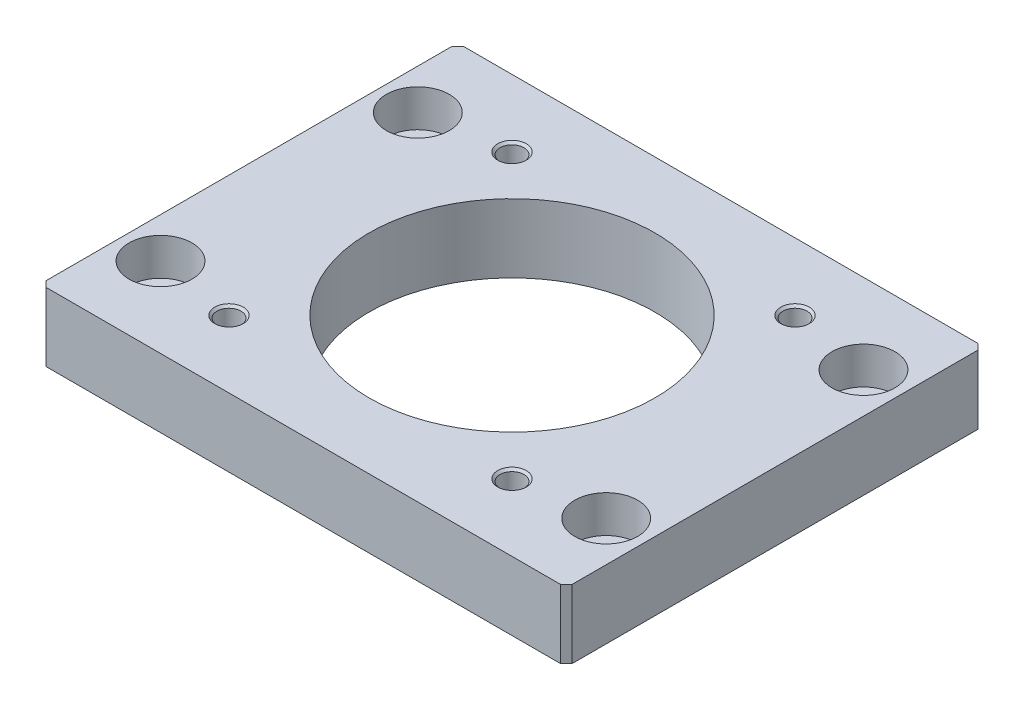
ISO-10303-21;
HEADER;
FILE_DESCRIPTION(('STEP AP214'),'2;1');
FILE_NAME('part.step','',(''),(''),'','','');
FILE_SCHEMA(('AUTOMOTIVE_DESIGN { 1 0 10303 214 1 1 1 1 }'));
ENDSEC;
DATA;
#1=APPLICATION_CONTEXT('core data for automotive mechanical design processes');
#2=APPLICATION_PROTOCOL_DEFINITION('international standard','automotive_design',2000,#1);
#3=PRODUCT_CONTEXT('',#1,'mechanical');
#4=PRODUCT('Part','Part','',(#3));
#5=PRODUCT_RELATED_PRODUCT_CATEGORY('part','',(#4));
#6=PRODUCT_DEFINITION_FORMATION('','',#4);
#7=PRODUCT_DEFINITION_CONTEXT('part definition',#1,'design');
#8=PRODUCT_DEFINITION('design','',#6,#7);
#9=PRODUCT_DEFINITION_SHAPE('','',#8);
#10=(LENGTH_UNIT() NAMED_UNIT(*) SI_UNIT(.MILLI.,.METRE.));
#11=(NAMED_UNIT(*) PLANE_ANGLE_UNIT() SI_UNIT($,.RADIAN.));
#12=(NAMED_UNIT(*) SI_UNIT($,.STERADIAN.) SOLID_ANGLE_UNIT());
#13=UNCERTAINTY_MEASURE_WITH_UNIT(LENGTH_MEASURE(1.E-05),#10,'distance_accuracy_value','');
#14=(GEOMETRIC_REPRESENTATION_CONTEXT(3) GLOBAL_UNCERTAINTY_ASSIGNED_CONTEXT((#13)) GLOBAL_UNIT_ASSIGNED_CONTEXT((#10,
#11,#12)) REPRESENTATION_CONTEXT('',''));
#15=CARTESIAN_POINT('',(0.,0.,0.));
#16=DIRECTION('',(0.,0.,1.));
#17=DIRECTION('',(1.,0.,0.));
#18=AXIS2_PLACEMENT_3D('',#15,#16,#17);
#19=CARTESIAN_POINT('',(-24.74873734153,11.6000000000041,-24.74873734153));
#20=DIRECTION('',(0.,1.,0.));
#21=DIRECTION('',(-1.,0.,0.));
#22=AXIS2_PLACEMENT_3D('',#19,#20,#21);
#23=CONICAL_SURFACE('',#22,2.09999999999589,0.785398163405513);
#24=CARTESIAN_POINT('',(-24.74873734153,11.6,-24.74873734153));
#25=DIRECTION('',(0.,1.,0.));
#26=DIRECTION('',(1.,0.,0.));
#27=AXIS2_PLACEMENT_3D('',#24,#25,#26);
#28=CIRCLE('',#27,2.1);
#29=CARTESIAN_POINT('',(-22.64873734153,11.6,-24.74873734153));
#30=VERTEX_POINT('',#29);
#31=EDGE_CURVE('E191',#30,#30,#28,.F.);
#32=ORIENTED_EDGE('',*,*,#31,.T.);
#33=EDGE_LOOP('',(#32));
#34=FACE_BOUND('',#33,.T.);
#35=CARTESIAN_POINT('',(-24.74873734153,12.0000000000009,-24.74873734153));
#36=DIRECTION('',(0.,1.,0.));
#37=DIRECTION('',(-1.,0.,0.));
#38=AXIS2_PLACEMENT_3D('',#35,#36,#37);
#39=CIRCLE('',#38,2.49999999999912);
#40=CARTESIAN_POINT('',(-27.2487373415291,12.0000000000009,-24.74873734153));
#41=VERTEX_POINT('',#40);
#42=EDGE_CURVE('E174',#41,#41,#39,.T.);
#43=ORIENTED_EDGE('',*,*,#42,.T.);
#44=EDGE_LOOP('',(#43));
#45=FACE_BOUND('',#44,.T.);
#46=ADVANCED_FACE('F16',(#34,#45),#23,.F.);
#47=CARTESIAN_POINT('',(24.74873734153,11.6000000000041,-24.74873734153));
#48=DIRECTION('',(0.,1.,0.));
#49=DIRECTION('',(-1.,0.,0.));
#50=AXIS2_PLACEMENT_3D('',#47,#48,#49);
#51=CONICAL_SURFACE('',#50,2.09999999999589,0.785398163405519);
#52=CARTESIAN_POINT('',(24.74873734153,11.6,-24.74873734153));
#53=DIRECTION('',(0.,1.,0.));
#54=DIRECTION('',(1.,0.,0.));
#55=AXIS2_PLACEMENT_3D('',#52,#53,#54);
#56=CIRCLE('',#55,2.1);
#57=CARTESIAN_POINT('',(26.84873734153,11.6,-24.74873734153));
#58=VERTEX_POINT('',#57);
#59=EDGE_CURVE('E195',#58,#58,#56,.F.);
#60=ORIENTED_EDGE('',*,*,#59,.T.);
#61=EDGE_LOOP('',(#60));
#62=FACE_BOUND('',#61,.T.);
#63=CARTESIAN_POINT('',(24.74873734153,12.0000000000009,-24.74873734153));
#64=DIRECTION('',(0.,1.,0.));
#65=DIRECTION('',(-1.,0.,0.));
#66=AXIS2_PLACEMENT_3D('',#63,#64,#65);
#67=CIRCLE('',#66,2.49999999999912);
#68=CARTESIAN_POINT('',(22.2487373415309,12.0000000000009,-24.74873734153));
#69=VERTEX_POINT('',#68);
#70=EDGE_CURVE('E171',#69,#69,#67,.T.);
#71=ORIENTED_EDGE('',*,*,#70,.T.);
#72=EDGE_LOOP('',(#71));
#73=FACE_BOUND('',#72,.T.);
#74=ADVANCED_FACE('F359',(#62,#73),#51,.F.);
#75=CARTESIAN_POINT('',(-24.74873734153,11.6,24.74873734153));
#76=DIRECTION('',(0.,1.,0.));
#77=DIRECTION('',(0.,0.,1.));
#78=AXIS2_PLACEMENT_3D('',#75,#76,#77);
#79=CONICAL_SURFACE('',#78,2.1,0.785398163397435);
#80=CARTESIAN_POINT('',(-24.74873734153,11.6,24.74873734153));
#81=DIRECTION('',(0.,1.,0.));
#82=DIRECTION('',(1.,0.,0.));
#83=AXIS2_PLACEMENT_3D('',#80,#81,#82);
#84=CIRCLE('',#83,2.1);
#85=CARTESIAN_POINT('',(-22.64873734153,11.6,24.74873734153));
#86=VERTEX_POINT('',#85);
#87=EDGE_CURVE('E208',#86,#86,#84,.F.);
#88=ORIENTED_EDGE('',*,*,#87,.T.);
#89=EDGE_LOOP('',(#88));
#90=FACE_BOUND('',#89,.T.);
#91=CARTESIAN_POINT('',(-24.74873734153,12.,24.74873734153));
#92=DIRECTION('',(0.,1.,0.));
#93=DIRECTION('',(0.,0.,1.));
#94=AXIS2_PLACEMENT_3D('',#91,#92,#93);
#95=CIRCLE('',#94,2.49999999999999);
#96=CARTESIAN_POINT('',(-24.74873734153,12.,27.24873734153));
#97=VERTEX_POINT('',#96);
#98=EDGE_CURVE('E168',#97,#97,#95,.T.);
#99=ORIENTED_EDGE('',*,*,#98,.T.);
#100=EDGE_LOOP('',(#99));
#101=FACE_BOUND('',#100,.T.);
#102=ADVANCED_FACE('F355',(#90,#101),#79,.F.);
#103=CARTESIAN_POINT('',(24.74873734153,11.6,24.74873734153));
#104=DIRECTION('',(0.,1.,0.));
#105=DIRECTION('',(0.,0.,1.));
#106=AXIS2_PLACEMENT_3D('',#103,#104,#105);
#107=CONICAL_SURFACE('',#106,2.1,0.785398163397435);
#108=CARTESIAN_POINT('',(24.74873734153,11.6,24.74873734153));
#109=DIRECTION('',(0.,1.,0.));
#110=DIRECTION('',(1.,0.,0.));
#111=AXIS2_PLACEMENT_3D('',#108,#109,#110);
#112=CIRCLE('',#111,2.1);
#113=CARTESIAN_POINT('',(26.84873734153,11.6,24.74873734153));
#114=VERTEX_POINT('',#113);
#115=EDGE_CURVE('E200',#114,#114,#112,.F.);
#116=ORIENTED_EDGE('',*,*,#115,.T.);
#117=EDGE_LOOP('',(#116));
#118=FACE_BOUND('',#117,.T.);
#119=CARTESIAN_POINT('',(24.74873734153,12.,24.74873734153));
#120=DIRECTION('',(0.,1.,0.));
#121=DIRECTION('',(0.,0.,1.));
#122=AXIS2_PLACEMENT_3D('',#119,#120,#121);
#123=CIRCLE('',#122,2.49999999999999);
#124=CARTESIAN_POINT('',(24.74873734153,12.,27.24873734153));
#125=VERTEX_POINT('',#124);
#126=EDGE_CURVE('E165',#125,#125,#123,.T.);
#127=ORIENTED_EDGE('',*,*,#126,.T.);
#128=EDGE_LOOP('',(#127));
#129=FACE_BOUND('',#128,.T.);
#130=ADVANCED_FACE('F352',(#118,#129),#107,.F.);
#131=CARTESIAN_POINT('',(38.9711431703,5.5,-22.5));
#132=DIRECTION('',(0.,1.,0.));
#133=DIRECTION('',(0.,0.,1.));
#134=AXIS2_PLACEMENT_3D('',#131,#132,#133);
#135=CYLINDRICAL_SURFACE('',#134,5.49999999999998);
#136=CARTESIAN_POINT('',(38.9711431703,5.5,-22.5));
#137=DIRECTION('',(0.,1.,0.));
#138=DIRECTION('',(0.,0.,1.));
#139=AXIS2_PLACEMENT_3D('',#136,#137,#138);
#140=CIRCLE('',#139,5.49999999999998);
#141=CARTESIAN_POINT('',(38.9711431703,5.5,-17.));
#142=VERTEX_POINT('',#141);
#143=EDGE_CURVE('E20',#142,#142,#140,.F.);
#144=ORIENTED_EDGE('',*,*,#143,.T.);
#145=EDGE_LOOP('',(#144));
#146=FACE_BOUND('',#145,.T.);
#147=CARTESIAN_POINT('',(38.9711431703,12.,-22.5));
#148=DIRECTION('',(0.,1.,0.));
#149=DIRECTION('',(0.,0.,1.));
#150=AXIS2_PLACEMENT_3D('',#147,#148,#149);
#151=CIRCLE('',#150,5.49999999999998);
#152=CARTESIAN_POINT('',(38.9711431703,12.,-17.));
#153=VERTEX_POINT('',#152);
#154=EDGE_CURVE('E162',#153,#153,#151,.T.);
#155=ORIENTED_EDGE('',*,*,#154,.T.);
#156=EDGE_LOOP('',(#155));
#157=FACE_BOUND('',#156,.T.);
#158=ADVANCED_FACE('F348',(#146,#157),#135,.F.);
#159=CARTESIAN_POINT('',(-38.9711431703,5.5,-22.5));
#160=DIRECTION('',(0.,1.,0.));
#161=DIRECTION('',(0.,0.,1.));
#162=AXIS2_PLACEMENT_3D('',#159,#160,#161);
#163=CYLINDRICAL_SURFACE('',#162,5.5);
#164=CARTESIAN_POINT('',(-38.9711431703,5.5,-22.5));
#165=DIRECTION('',(0.,1.,0.));
#166=DIRECTION('',(0.,0.,1.));
#167=AXIS2_PLACEMENT_3D('',#164,#165,#166);
#168=CIRCLE('',#167,5.5);
#169=CARTESIAN_POINT('',(-38.9711431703,5.5,-17.));
#170=VERTEX_POINT('',#169);
#171=EDGE_CURVE('E184',#170,#170,#168,.F.);
#172=ORIENTED_EDGE('',*,*,#171,.T.);
#173=EDGE_LOOP('',(#172));
#174=FACE_BOUND('',#173,.T.);
#175=CARTESIAN_POINT('',(-38.9711431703,12.,-22.5));
#176=DIRECTION('',(0.,1.,0.));
#177=DIRECTION('',(0.,0.,1.));
#178=AXIS2_PLACEMENT_3D('',#175,#176,#177);
#179=CIRCLE('',#178,5.5);
#180=CARTESIAN_POINT('',(-38.9711431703,12.,-17.));
#181=VERTEX_POINT('',#180);
#182=EDGE_CURVE('E159',#181,#181,#179,.T.);
#183=ORIENTED_EDGE('',*,*,#182,.T.);
#184=EDGE_LOOP('',(#183));
#185=FACE_BOUND('',#184,.T.);
#186=ADVANCED_FACE('F344',(#174,#185),#163,.F.);
#187=CARTESIAN_POINT('',(-38.9711431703,5.5,22.5));
#188=DIRECTION('',(0.,1.,0.));
#189=DIRECTION('',(0.,0.,1.));
#190=AXIS2_PLACEMENT_3D('',#187,#188,#189);
#191=CYLINDRICAL_SURFACE('',#190,5.5);
#192=CARTESIAN_POINT('',(-38.9711431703,5.5,22.5));
#193=DIRECTION('',(0.,1.,0.));
#194=DIRECTION('',(0.,0.,1.));
#195=AXIS2_PLACEMENT_3D('',#192,#193,#194);
#196=CIRCLE('',#195,5.5);
#197=CARTESIAN_POINT('',(-38.9711431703,5.5,28.));
#198=VERTEX_POINT('',#197);
#199=EDGE_CURVE('E90',#198,#198,#196,.F.);
#200=ORIENTED_EDGE('',*,*,#199,.T.);
#201=EDGE_LOOP('',(#200));
#202=FACE_BOUND('',#201,.T.);
#203=CARTESIAN_POINT('',(-38.9711431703,12.,22.5));
#204=DIRECTION('',(0.,1.,0.));
#205=DIRECTION('',(0.,0.,1.));
#206=AXIS2_PLACEMENT_3D('',#203,#204,#205);
#207=CIRCLE('',#206,5.5);
#208=CARTESIAN_POINT('',(-38.9711431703,12.,28.));
#209=VERTEX_POINT('',#208);
#210=EDGE_CURVE('E107',#209,#209,#207,.T.);
#211=ORIENTED_EDGE('',*,*,#210,.T.);
#212=EDGE_LOOP('',(#211));
#213=FACE_BOUND('',#212,.T.);
#214=ADVANCED_FACE('F341',(#202,#213),#191,.F.);
#215=CARTESIAN_POINT('',(38.9711431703,5.5,22.5));
#216=DIRECTION('',(0.,1.,0.));
#217=DIRECTION('',(0.,0.,1.));
#218=AXIS2_PLACEMENT_3D('',#215,#216,#217);
#219=CYLINDRICAL_SURFACE('',#218,5.49999999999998);
#220=CARTESIAN_POINT('',(38.9711431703,5.5,22.5));
#221=DIRECTION('',(0.,1.,0.));
#222=DIRECTION('',(0.,0.,1.));
#223=AXIS2_PLACEMENT_3D('',#220,#221,#222);
#224=CIRCLE('',#223,5.49999999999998);
#225=CARTESIAN_POINT('',(38.9711431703,5.5,28.));
#226=VERTEX_POINT('',#225);
#227=EDGE_CURVE('E186',#226,#226,#224,.F.);
#228=ORIENTED_EDGE('',*,*,#227,.T.);
#229=EDGE_LOOP('',(#228));
#230=FACE_BOUND('',#229,.T.);
#231=CARTESIAN_POINT('',(38.9711431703,12.,22.5));
#232=DIRECTION('',(0.,1.,0.));
#233=DIRECTION('',(0.,0.,1.));
#234=AXIS2_PLACEMENT_3D('',#231,#232,#233);
#235=CIRCLE('',#234,5.49999999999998);
#236=CARTESIAN_POINT('',(38.9711431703,12.,28.));
#237=VERTEX_POINT('',#236);
#238=EDGE_CURVE('E104',#237,#237,#235,.T.);
#239=ORIENTED_EDGE('',*,*,#238,.T.);
#240=EDGE_LOOP('',(#239));
#241=FACE_BOUND('',#240,.T.);
#242=ADVANCED_FACE('F338',(#230,#241),#219,.F.);
#243=CARTESIAN_POINT('',(-46.10961962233,12.24,-35.39038037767));
#244=DIRECTION('',(-0.707106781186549,0.,-0.707106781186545));
#245=DIRECTION('',(0.707106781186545,0.,-0.707106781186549));
#246=AXIS2_PLACEMENT_3D('',#243,#244,#245);
#247=PLANE('',#246);
#248=DIRECTION('',(0.707106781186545,0.,-0.707106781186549));
#249=VECTOR('',#248,1.);
#250=CARTESIAN_POINT('',(-46.10961962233,12.,-35.39038037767));
#251=LINE('',#250,#249);
#252=CARTESIAN_POINT('',(-46.,12.,-35.5));
#253=VERTEX_POINT('',#252);
#254=CARTESIAN_POINT('',(-45.,12.,-36.5));
#255=VERTEX_POINT('',#254);
#256=EDGE_CURVE('E177',#253,#255,#251,.T.);
#257=ORIENTED_EDGE('',*,*,#256,.T.);
#258=DIRECTION('',(0.,1.,0.));
#259=VECTOR('',#258,1.);
#260=CARTESIAN_POINT('',(-45.,6.,-36.5));
#261=LINE('',#260,#259);
#262=CARTESIAN_POINT('',(-45.,0.,-36.5));
#263=VERTEX_POINT('',#262);
#264=EDGE_CURVE('E100',#255,#263,#261,.F.);
#265=ORIENTED_EDGE('',*,*,#264,.T.);
#266=DIRECTION('',(-0.707106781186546,0.,0.70710678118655));
#267=VECTOR('',#266,1.);
#268=CARTESIAN_POINT('',(-45.5,0.,-36.));
#269=LINE('',#268,#267);
#270=CARTESIAN_POINT('',(-46.,0.,-35.5));
#271=VERTEX_POINT('',#270);
#272=EDGE_CURVE('E203',#271,#263,#269,.F.);
#273=ORIENTED_EDGE('',*,*,#272,.F.);
#274=DIRECTION('',(0.,-1.,0.));
#275=VECTOR('',#274,1.);
#276=CARTESIAN_POINT('',(-46.,6.,-35.5));
#277=LINE('',#276,#275);
#278=EDGE_CURVE('E215',#271,#253,#277,.F.);
#279=ORIENTED_EDGE('',*,*,#278,.T.);
#280=EDGE_LOOP('',(#257,#265,#273,#279));
#281=FACE_BOUND('',#280,.T.);
#282=ADVANCED_FACE('F261',(#281),#247,.T.);
#283=CARTESIAN_POINT('',(-44.89038037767,12.24,36.60961962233));
#284=DIRECTION('',(-0.707106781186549,0.,0.707106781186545));
#285=DIRECTION('',(-0.707106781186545,0.,-0.707106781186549));
#286=AXIS2_PLACEMENT_3D('',#283,#284,#285);
#287=PLANE('',#286);
#288=DIRECTION('',(-0.707106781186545,0.,-0.707106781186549));
#289=VECTOR('',#288,1.);
#290=CARTESIAN_POINT('',(-44.89038037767,12.,36.60961962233));
#291=LINE('',#290,#289);
#292=CARTESIAN_POINT('',(-45.,12.,36.5));
#293=VERTEX_POINT('',#292);
#294=CARTESIAN_POINT('',(-46.,12.,35.5));
#295=VERTEX_POINT('',#294);
#296=EDGE_CURVE('E179',#293,#295,#291,.T.);
#297=ORIENTED_EDGE('',*,*,#296,.T.);
#298=DIRECTION('',(0.,1.,0.));
#299=VECTOR('',#298,1.);
#300=CARTESIAN_POINT('',(-46.,6.,35.5));
#301=LINE('',#300,#299);
#302=CARTESIAN_POINT('',(-46.,0.,35.5));
#303=VERTEX_POINT('',#302);
#304=EDGE_CURVE('E214',#295,#303,#301,.F.);
#305=ORIENTED_EDGE('',*,*,#304,.T.);
#306=DIRECTION('',(0.707106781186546,0.,0.70710678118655));
#307=VECTOR('',#306,1.);
#308=CARTESIAN_POINT('',(-45.5,0.,36.));
#309=LINE('',#308,#307);
#310=CARTESIAN_POINT('',(-45.,0.,36.5));
#311=VERTEX_POINT('',#310);
#312=EDGE_CURVE('E257',#311,#303,#309,.F.);
#313=ORIENTED_EDGE('',*,*,#312,.F.);
#314=DIRECTION('',(0.,-1.,0.));
#315=VECTOR('',#314,1.);
#316=CARTESIAN_POINT('',(-45.,6.,36.5));
#317=LINE('',#316,#315);
#318=EDGE_CURVE('E222',#311,#293,#317,.F.);
#319=ORIENTED_EDGE('',*,*,#318,.T.);
#320=EDGE_LOOP('',(#297,#305,#313,#319));
#321=FACE_BOUND('',#320,.T.);
#322=ADVANCED_FACE('F267',(#321),#287,.T.);
#323=CARTESIAN_POINT('',(44.89038037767,12.24,-36.60961962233));
#324=DIRECTION('',(0.707106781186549,0.,-0.707106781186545));
#325=DIRECTION('',(0.707106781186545,0.,0.707106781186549));
#326=AXIS2_PLACEMENT_3D('',#323,#324,#325);
#327=PLANE('',#326);
#328=DIRECTION('',(0.707106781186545,0.,0.707106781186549));
#329=VECTOR('',#328,1.);
#330=CARTESIAN_POINT('',(44.89038037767,12.,-36.60961962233));
#331=LINE('',#330,#329);
#332=CARTESIAN_POINT('',(45.,12.,-36.5));
#333=VERTEX_POINT('',#332);
#334=CARTESIAN_POINT('',(46.,12.,-35.5));
#335=VERTEX_POINT('',#334);
#336=EDGE_CURVE('E80',#333,#335,#331,.T.);
#337=ORIENTED_EDGE('',*,*,#336,.T.);
#338=DIRECTION('',(0.,1.,0.));
#339=VECTOR('',#338,1.);
#340=CARTESIAN_POINT('',(46.,6.,-35.5));
#341=LINE('',#340,#339);
#342=CARTESIAN_POINT('',(46.,0.,-35.5));
#343=VERTEX_POINT('',#342);
#344=EDGE_CURVE('E113',#335,#343,#341,.F.);
#345=ORIENTED_EDGE('',*,*,#344,.T.);
#346=DIRECTION('',(-0.707106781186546,0.,-0.70710678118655));
#347=VECTOR('',#346,1.);
#348=CARTESIAN_POINT('',(45.5,0.,-36.));
#349=LINE('',#348,#347);
#350=CARTESIAN_POINT('',(45.,0.,-36.5));
#351=VERTEX_POINT('',#350);
#352=EDGE_CURVE('E103',#351,#343,#349,.F.);
#353=ORIENTED_EDGE('',*,*,#352,.F.);
#354=DIRECTION('',(0.,-1.,0.));
#355=VECTOR('',#354,1.);
#356=CARTESIAN_POINT('',(45.,6.,-36.5));
#357=LINE('',#356,#355);
#358=EDGE_CURVE('E97',#351,#333,#357,.F.);
#359=ORIENTED_EDGE('',*,*,#358,.T.);
#360=EDGE_LOOP('',(#337,#345,#353,#359));
#361=FACE_BOUND('',#360,.T.);
#362=ADVANCED_FACE('F102',(#361),#327,.T.);
#363=CARTESIAN_POINT('',(46.10961962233,12.24,35.39038037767));
#364=DIRECTION('',(0.707106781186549,0.,0.707106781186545));
#365=DIRECTION('',(-0.707106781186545,0.,0.707106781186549));
#366=AXIS2_PLACEMENT_3D('',#363,#364,#365);
#367=PLANE('',#366);
#368=DIRECTION('',(-0.707106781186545,0.,0.707106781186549));
#369=VECTOR('',#368,1.);
#370=CARTESIAN_POINT('',(46.10961962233,12.,35.39038037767));
#371=LINE('',#370,#369);
#372=CARTESIAN_POINT('',(46.,12.,35.5));
#373=VERTEX_POINT('',#372);
#374=CARTESIAN_POINT('',(45.,12.,36.5));
#375=VERTEX_POINT('',#374);
#376=EDGE_CURVE('E89',#373,#375,#371,.T.);
#377=ORIENTED_EDGE('',*,*,#376,.T.);
#378=DIRECTION('',(0.,1.,0.));
#379=VECTOR('',#378,1.);
#380=CARTESIAN_POINT('',(45.,6.,36.5));
#381=LINE('',#380,#379);
#382=CARTESIAN_POINT('',(45.,0.,36.5));
#383=VERTEX_POINT('',#382);
#384=EDGE_CURVE('E111',#375,#383,#381,.F.);
#385=ORIENTED_EDGE('',*,*,#384,.T.);
#386=DIRECTION('',(0.707106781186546,0.,-0.70710678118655));
#387=VECTOR('',#386,1.);
#388=CARTESIAN_POINT('',(45.5,0.,36.));
#389=LINE('',#388,#387);
#390=CARTESIAN_POINT('',(46.,0.,35.5));
#391=VERTEX_POINT('',#390);
#392=EDGE_CURVE('E35',#391,#383,#389,.F.);
#393=ORIENTED_EDGE('',*,*,#392,.F.);
#394=DIRECTION('',(0.,-1.,0.));
#395=VECTOR('',#394,1.);
#396=CARTESIAN_POINT('',(46.,6.,35.5));
#397=LINE('',#396,#395);
#398=EDGE_CURVE('E114',#391,#373,#397,.F.);
#399=ORIENTED_EDGE('',*,*,#398,.T.);
#400=EDGE_LOOP('',(#377,#385,#393,#399));
#401=FACE_BOUND('',#400,.T.);
#402=ADVANCED_FACE('F228',(#401),#367,.T.);
#403=CARTESIAN_POINT('',(-24.74873734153,0.399999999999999,24.74873734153));
#404=DIRECTION('',(0.,1.,0.));
#405=DIRECTION('',(0.,0.,1.));
#406=AXIS2_PLACEMENT_3D('',#403,#404,#405);
#407=CYLINDRICAL_SURFACE('',#406,2.1);
#408=CARTESIAN_POINT('',(-24.74873734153,0.400000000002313,24.74873734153));
#409=DIRECTION('',(0.,-1.,0.));
#410=DIRECTION('',(0.,0.,-1.));
#411=AXIS2_PLACEMENT_3D('',#408,#409,#410);
#412=CIRCLE('',#411,2.10000000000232);
#413=CARTESIAN_POINT('',(-24.74873734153,0.400000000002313,22.6487373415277));
#414=VERTEX_POINT('',#413);
#415=EDGE_CURVE('E227',#414,#414,#412,.T.);
#416=ORIENTED_EDGE('',*,*,#415,.T.);
#417=EDGE_LOOP('',(#416));
#418=FACE_BOUND('',#417,.T.);
#419=ORIENTED_EDGE('',*,*,#87,.F.);
#420=EDGE_LOOP('',(#419));
#421=FACE_BOUND('',#420,.T.);
#422=ADVANCED_FACE('F333',(#418,#421),#407,.F.);
#423=CARTESIAN_POINT('',(24.74873734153,0.399999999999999,24.74873734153));
#424=DIRECTION('',(0.,1.,0.));
#425=DIRECTION('',(0.,0.,1.));
#426=AXIS2_PLACEMENT_3D('',#423,#424,#425);
#427=CYLINDRICAL_SURFACE('',#426,2.1);
#428=CARTESIAN_POINT('',(24.74873734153,0.400000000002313,24.74873734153));
#429=DIRECTION('',(0.,-1.,0.));
#430=DIRECTION('',(0.,0.,-1.));
#431=AXIS2_PLACEMENT_3D('',#428,#429,#430);
#432=CIRCLE('',#431,2.10000000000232);
#433=CARTESIAN_POINT('',(24.74873734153,0.400000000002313,22.6487373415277));
#434=VERTEX_POINT('',#433);
#435=EDGE_CURVE('E251',#434,#434,#432,.T.);
#436=ORIENTED_EDGE('',*,*,#435,.T.);
#437=EDGE_LOOP('',(#436));
#438=FACE_BOUND('',#437,.T.);
#439=ORIENTED_EDGE('',*,*,#115,.F.);
#440=EDGE_LOOP('',(#439));
#441=FACE_BOUND('',#440,.T.);
#442=ADVANCED_FACE('F329',(#438,#441),#427,.F.);
#443=CARTESIAN_POINT('',(24.74873734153,0.399999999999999,-24.74873734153));
#444=DIRECTION('',(0.,1.,0.));
#445=DIRECTION('',(0.,0.,1.));
#446=AXIS2_PLACEMENT_3D('',#443,#444,#445);
#447=CYLINDRICAL_SURFACE('',#446,2.1);
#448=CARTESIAN_POINT('',(24.74873734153,0.399999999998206,-24.74873734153));
#449=DIRECTION('',(0.,-1.,0.));
#450=DIRECTION('',(0.,0.,-1.));
#451=AXIS2_PLACEMENT_3D('',#448,#449,#450);
#452=CIRCLE('',#451,2.09999999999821);
#453=CARTESIAN_POINT('',(24.74873734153,0.399999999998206,-26.8487373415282));
#454=VERTEX_POINT('',#453);
#455=EDGE_CURVE('E248',#454,#454,#452,.T.);
#456=ORIENTED_EDGE('',*,*,#455,.T.);
#457=EDGE_LOOP('',(#456));
#458=FACE_BOUND('',#457,.T.);
#459=ORIENTED_EDGE('',*,*,#59,.F.);
#460=EDGE_LOOP('',(#459));
#461=FACE_BOUND('',#460,.T.);
#462=ADVANCED_FACE('F325',(#458,#461),#447,.F.);
#463=CARTESIAN_POINT('',(-24.74873734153,0.399999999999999,-24.74873734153));
#464=DIRECTION('',(0.,1.,0.));
#465=DIRECTION('',(0.,0.,1.));
#466=AXIS2_PLACEMENT_3D('',#463,#464,#465);
#467=CYLINDRICAL_SURFACE('',#466,2.1);
#468=CARTESIAN_POINT('',(-24.74873734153,0.399999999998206,-24.74873734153));
#469=DIRECTION('',(0.,-1.,0.));
#470=DIRECTION('',(0.,0.,-1.));
#471=AXIS2_PLACEMENT_3D('',#468,#469,#470);
#472=CIRCLE('',#471,2.09999999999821);
#473=CARTESIAN_POINT('',(-24.74873734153,0.399999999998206,-26.8487373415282));
#474=VERTEX_POINT('',#473);
#475=EDGE_CURVE('E155',#474,#474,#472,.T.);
#476=ORIENTED_EDGE('',*,*,#475,.T.);
#477=EDGE_LOOP('',(#476));
#478=FACE_BOUND('',#477,.T.);
#479=ORIENTED_EDGE('',*,*,#31,.F.);
#480=EDGE_LOOP('',(#479));
#481=FACE_BOUND('',#480,.T.);
#482=ADVANCED_FACE('F321',(#478,#481),#467,.F.);
#483=CARTESIAN_POINT('',(-46.24998889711,5.5,29.13192006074));
#484=DIRECTION('',(0.,1.,0.));
#485=DIRECTION('',(1.,0.,0.));
#486=AXIS2_PLACEMENT_3D('',#483,#484,#485);
#487=PLANE('',#486);
#488=CARTESIAN_POINT('',(38.9711431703,5.5,-22.5));
#489=DIRECTION('',(0.,1.,0.));
#490=DIRECTION('',(0.,0.,1.));
#491=AXIS2_PLACEMENT_3D('',#488,#489,#490);
#492=CIRCLE('',#491,3.24999999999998);
#493=CARTESIAN_POINT('',(38.9711431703,5.5,-19.25));
#494=VERTEX_POINT('',#493);
#495=EDGE_CURVE('E153',#494,#494,#492,.F.);
#496=ORIENTED_EDGE('',*,*,#495,.T.);
#497=EDGE_LOOP('',(#496));
#498=FACE_BOUND('',#497,.T.);
#499=ORIENTED_EDGE('',*,*,#143,.F.);
#500=EDGE_LOOP('',(#499));
#501=FACE_BOUND('',#500,.T.);
#502=ADVANCED_FACE('F324',(#498,#501),#487,.T.);
#503=CARTESIAN_POINT('',(-46.24998889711,5.5,29.13192006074));
#504=DIRECTION('',(0.,1.,0.));
#505=DIRECTION('',(1.,0.,0.));
#506=AXIS2_PLACEMENT_3D('',#503,#504,#505);
#507=PLANE('',#506);
#508=CARTESIAN_POINT('',(38.9711431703,5.5,22.5));
#509=DIRECTION('',(0.,1.,0.));
#510=DIRECTION('',(0.,0.,1.));
#511=AXIS2_PLACEMENT_3D('',#508,#509,#510);
#512=CIRCLE('',#511,3.24999999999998);
#513=CARTESIAN_POINT('',(38.9711431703,5.5,25.75));
#514=VERTEX_POINT('',#513);
#515=EDGE_CURVE('E150',#514,#514,#512,.F.);
#516=ORIENTED_EDGE('',*,*,#515,.T.);
#517=EDGE_LOOP('',(#516));
#518=FACE_BOUND('',#517,.T.);
#519=ORIENTED_EDGE('',*,*,#227,.F.);
#520=EDGE_LOOP('',(#519));
#521=FACE_BOUND('',#520,.T.);
#522=ADVANCED_FACE('F376',(#518,#521),#507,.T.);
#523=CARTESIAN_POINT('',(-46.24998889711,5.5,29.13192006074));
#524=DIRECTION('',(0.,1.,0.));
#525=DIRECTION('',(1.,0.,0.));
#526=AXIS2_PLACEMENT_3D('',#523,#524,#525);
#527=PLANE('',#526);
#528=CARTESIAN_POINT('',(-38.9711431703,5.5,-22.5));
#529=DIRECTION('',(0.,1.,0.));
#530=DIRECTION('',(0.,0.,1.));
#531=AXIS2_PLACEMENT_3D('',#528,#529,#530);
#532=CIRCLE('',#531,3.25);
#533=CARTESIAN_POINT('',(-38.9711431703,5.5,-19.25));
#534=VERTEX_POINT('',#533);
#535=EDGE_CURVE('E147',#534,#534,#532,.F.);
#536=ORIENTED_EDGE('',*,*,#535,.T.);
#537=EDGE_LOOP('',(#536));
#538=FACE_BOUND('',#537,.T.);
#539=ORIENTED_EDGE('',*,*,#171,.F.);
#540=EDGE_LOOP('',(#539));
#541=FACE_BOUND('',#540,.T.);
#542=ADVANCED_FACE('F380',(#538,#541),#527,.T.);
#543=CARTESIAN_POINT('',(-46.24998889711,5.5,29.13192006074));
#544=DIRECTION('',(0.,1.,0.));
#545=DIRECTION('',(1.,0.,0.));
#546=AXIS2_PLACEMENT_3D('',#543,#544,#545);
#547=PLANE('',#546);
#548=CARTESIAN_POINT('',(-38.9711431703,5.5,22.5));
#549=DIRECTION('',(0.,1.,0.));
#550=DIRECTION('',(0.,0.,1.));
#551=AXIS2_PLACEMENT_3D('',#548,#549,#550);
#552=CIRCLE('',#551,3.25);
#553=CARTESIAN_POINT('',(-38.9711431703,5.5,25.75));
#554=VERTEX_POINT('',#553);
#555=EDGE_CURVE('E144',#554,#554,#552,.F.);
#556=ORIENTED_EDGE('',*,*,#555,.T.);
#557=EDGE_LOOP('',(#556));
#558=FACE_BOUND('',#557,.T.);
#559=ORIENTED_EDGE('',*,*,#199,.F.);
#560=EDGE_LOOP('',(#559));
#561=FACE_BOUND('',#560,.T.);
#562=ADVANCED_FACE('F384',(#558,#561),#547,.T.);
#563=CARTESIAN_POINT('',(-47.84,12.,37.96));
#564=DIRECTION('',(0.,1.,0.));
#565=DIRECTION('',(1.,0.,0.));
#566=AXIS2_PLACEMENT_3D('',#563,#564,#565);
#567=PLANE('',#566);
#568=CARTESIAN_POINT('',(0.,12.,0.));
#569=DIRECTION('',(0.,1.,0.));
#570=DIRECTION('',(0.,0.,1.));
#571=AXIS2_PLACEMENT_3D('',#568,#569,#570);
#572=CIRCLE('',#571,25.);
#573=CARTESIAN_POINT('',(0.,12.,25.));
#574=VERTEX_POINT('',#573);
#575=EDGE_CURVE('E140',#574,#574,#572,.F.);
#576=ORIENTED_EDGE('',*,*,#575,.T.);
#577=EDGE_LOOP('',(#576));
#578=FACE_BOUND('',#577,.T.);
#579=ORIENTED_EDGE('',*,*,#238,.F.);
#580=EDGE_LOOP('',(#579));
#581=FACE_BOUND('',#580,.T.);
#582=ORIENTED_EDGE('',*,*,#210,.F.);
#583=EDGE_LOOP('',(#582));
#584=FACE_BOUND('',#583,.T.);
#585=ORIENTED_EDGE('',*,*,#182,.F.);
#586=EDGE_LOOP('',(#585));
#587=FACE_BOUND('',#586,.T.);
#588=ORIENTED_EDGE('',*,*,#154,.F.);
#589=EDGE_LOOP('',(#588));
#590=FACE_BOUND('',#589,.T.);
#591=ORIENTED_EDGE('',*,*,#126,.F.);
#592=EDGE_LOOP('',(#591));
#593=FACE_BOUND('',#592,.T.);
#594=ORIENTED_EDGE('',*,*,#98,.F.);
#595=EDGE_LOOP('',(#594));
#596=FACE_BOUND('',#595,.T.);
#597=ORIENTED_EDGE('',*,*,#70,.F.);
#598=EDGE_LOOP('',(#597));
#599=FACE_BOUND('',#598,.T.);
#600=ORIENTED_EDGE('',*,*,#42,.F.);
#601=EDGE_LOOP('',(#600));
#602=FACE_BOUND('',#601,.T.);
#603=ORIENTED_EDGE('',*,*,#256,.F.);
#604=DIRECTION('',(0.,0.,-1.));
#605=VECTOR('',#604,1.);
#606=CARTESIAN_POINT('',(-46.,12.,0.));
#607=LINE('',#606,#605);
#608=EDGE_CURVE('E211',#253,#295,#607,.F.);
#609=ORIENTED_EDGE('',*,*,#608,.T.);
#610=ORIENTED_EDGE('',*,*,#296,.F.);
#611=DIRECTION('',(-1.,0.,0.));
#612=VECTOR('',#611,1.);
#613=CARTESIAN_POINT('',(0.,12.,36.5));
#614=LINE('',#613,#612);
#615=EDGE_CURVE('E219',#293,#375,#614,.F.);
#616=ORIENTED_EDGE('',*,*,#615,.T.);
#617=ORIENTED_EDGE('',*,*,#376,.F.);
#618=DIRECTION('',(0.,0.,1.));
#619=VECTOR('',#618,1.);
#620=CARTESIAN_POINT('',(46.,12.,0.));
#621=LINE('',#620,#619);
#622=EDGE_CURVE('E85',#373,#335,#621,.F.);
#623=ORIENTED_EDGE('',*,*,#622,.T.);
#624=ORIENTED_EDGE('',*,*,#336,.F.);
#625=DIRECTION('',(1.,0.,0.));
#626=VECTOR('',#625,1.);
#627=CARTESIAN_POINT('',(0.,12.,-36.5));
#628=LINE('',#627,#626);
#629=EDGE_CURVE('E83',#333,#255,#628,.F.);
#630=ORIENTED_EDGE('',*,*,#629,.T.);
#631=EDGE_LOOP('',(#603,#609,#610,#616,#617,#623,#624,#630));
#632=FACE_BOUND('',#631,.T.);
#633=ADVANCED_FACE('F82',(#578,#581,#584,#587,#590,#593,#596,#599,#602,#632),#567,.T.);
#634=CARTESIAN_POINT('',(46.8,-0.24,-36.5));
#635=DIRECTION('',(0.,0.,-1.));
#636=DIRECTION('',(-1.,0.,0.));
#637=AXIS2_PLACEMENT_3D('',#634,#635,#636);
#638=PLANE('',#637);
#639=ORIENTED_EDGE('',*,*,#264,.F.);
#640=ORIENTED_EDGE('',*,*,#629,.F.);
#641=ORIENTED_EDGE('',*,*,#358,.F.);
#642=DIRECTION('',(-1.,0.,0.));
#643=VECTOR('',#642,1.);
#644=CARTESIAN_POINT('',(0.,0.,-36.5));
#645=LINE('',#644,#643);
#646=EDGE_CURVE('E143',#351,#263,#645,.T.);
#647=ORIENTED_EDGE('',*,*,#646,.T.);
#648=EDGE_LOOP('',(#639,#640,#641,#647));
#649=FACE_BOUND('',#648,.T.);
#650=ADVANCED_FACE('F95',(#649),#638,.T.);
#651=CARTESIAN_POINT('',(-46.,-0.24,-36.92));
#652=DIRECTION('',(-1.,0.,0.));
#653=DIRECTION('',(0.,0.,1.));
#654=AXIS2_PLACEMENT_3D('',#651,#652,#653);
#655=PLANE('',#654);
#656=ORIENTED_EDGE('',*,*,#304,.F.);
#657=ORIENTED_EDGE('',*,*,#608,.F.);
#658=ORIENTED_EDGE('',*,*,#278,.F.);
#659=DIRECTION('',(0.,0.,1.));
#660=VECTOR('',#659,1.);
#661=CARTESIAN_POINT('',(-46.,0.,0.));
#662=LINE('',#661,#660);
#663=EDGE_CURVE('E240',#271,#303,#662,.T.);
#664=ORIENTED_EDGE('',*,*,#663,.T.);
#665=EDGE_LOOP('',(#656,#657,#658,#664));
#666=FACE_BOUND('',#665,.T.);
#667=ADVANCED_FACE('F265',(#666),#655,.T.);
#668=CARTESIAN_POINT('',(-46.8,-0.24,36.5));
#669=DIRECTION('',(0.,0.,1.));
#670=DIRECTION('',(1.,0.,0.));
#671=AXIS2_PLACEMENT_3D('',#668,#669,#670);
#672=PLANE('',#671);
#673=ORIENTED_EDGE('',*,*,#384,.F.);
#674=ORIENTED_EDGE('',*,*,#615,.F.);
#675=ORIENTED_EDGE('',*,*,#318,.F.);
#676=DIRECTION('',(1.,0.,0.));
#677=VECTOR('',#676,1.);
#678=CARTESIAN_POINT('',(0.,0.,36.5));
#679=LINE('',#678,#677);
#680=EDGE_CURVE('E237',#311,#383,#679,.T.);
#681=ORIENTED_EDGE('',*,*,#680,.T.);
#682=EDGE_LOOP('',(#673,#674,#675,#681));
#683=FACE_BOUND('',#682,.T.);
#684=ADVANCED_FACE('F271',(#683),#672,.T.);
#685=CARTESIAN_POINT('',(46.,-0.24,36.92));
#686=DIRECTION('',(1.,0.,0.));
#687=DIRECTION('',(0.,0.,-1.));
#688=AXIS2_PLACEMENT_3D('',#685,#686,#687);
#689=PLANE('',#688);
#690=ORIENTED_EDGE('',*,*,#398,.F.);
#691=DIRECTION('',(0.,0.,-1.));
#692=VECTOR('',#691,1.);
#693=CARTESIAN_POINT('',(46.,0.,0.));
#694=LINE('',#693,#692);
#695=EDGE_CURVE('E139',#391,#343,#694,.T.);
#696=ORIENTED_EDGE('',*,*,#695,.T.);
#697=ORIENTED_EDGE('',*,*,#344,.F.);
#698=ORIENTED_EDGE('',*,*,#622,.F.);
#699=EDGE_LOOP('',(#690,#696,#697,#698));
#700=FACE_BOUND('',#699,.T.);
#701=ADVANCED_FACE('F233',(#700),#689,.T.);
#702=CARTESIAN_POINT('',(-24.74873734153,0.400000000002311,24.74873734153));
#703=DIRECTION('',(0.,-1.,0.));
#704=DIRECTION('',(0.,0.,-1.));
#705=AXIS2_PLACEMENT_3D('',#702,#703,#704);
#706=CONICAL_SURFACE('',#705,2.10000000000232,0.785398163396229);
#707=ORIENTED_EDGE('',*,*,#415,.F.);
#708=EDGE_LOOP('',(#707));
#709=FACE_BOUND('',#708,.T.);
#710=CARTESIAN_POINT('',(-24.74873734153,1.8249290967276E-12,24.74873734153));
#711=DIRECTION('',(0.,-1.,0.));
#712=DIRECTION('',(0.,0.,-1.));
#713=AXIS2_PLACEMENT_3D('',#710,#711,#712);
#714=CIRCLE('',#713,2.50000000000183);
#715=CARTESIAN_POINT('',(-24.74873734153,1.8249290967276E-12,22.2487373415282));
#716=VERTEX_POINT('',#715);
#717=EDGE_CURVE('E136',#716,#716,#714,.T.);
#718=ORIENTED_EDGE('',*,*,#717,.T.);
#719=EDGE_LOOP('',(#718));
#720=FACE_BOUND('',#719,.T.);
#721=ADVANCED_FACE('F279',(#709,#720),#706,.F.);
#722=CARTESIAN_POINT('',(24.74873734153,0.400000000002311,24.74873734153));
#723=DIRECTION('',(0.,-1.,0.));
#724=DIRECTION('',(0.,0.,-1.));
#725=AXIS2_PLACEMENT_3D('',#722,#723,#724);
#726=CONICAL_SURFACE('',#725,2.10000000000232,0.785398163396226);
#727=ORIENTED_EDGE('',*,*,#435,.F.);
#728=EDGE_LOOP('',(#727));
#729=FACE_BOUND('',#728,.T.);
#730=CARTESIAN_POINT('',(24.74873734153,1.82579645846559E-12,24.74873734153));
#731=DIRECTION('',(0.,-1.,0.));
#732=DIRECTION('',(0.,0.,-1.));
#733=AXIS2_PLACEMENT_3D('',#730,#731,#732);
#734=CIRCLE('',#733,2.50000000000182);
#735=CARTESIAN_POINT('',(24.74873734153,1.82579645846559E-12,22.2487373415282));
#736=VERTEX_POINT('',#735);
#737=EDGE_CURVE('E133',#736,#736,#734,.T.);
#738=ORIENTED_EDGE('',*,*,#737,.T.);
#739=EDGE_LOOP('',(#738));
#740=FACE_BOUND('',#739,.T.);
#741=ADVANCED_FACE('F309',(#729,#740),#726,.F.);
#742=CARTESIAN_POINT('',(24.74873734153,0.399999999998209,-24.74873734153));
#743=DIRECTION('',(0.,-1.,0.));
#744=DIRECTION('',(1.,0.,0.));
#745=AXIS2_PLACEMENT_3D('',#742,#743,#744);
#746=CONICAL_SURFACE('',#745,2.0999999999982,0.785398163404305);
#747=ORIENTED_EDGE('',*,*,#455,.F.);
#748=EDGE_LOOP('',(#747));
#749=FACE_BOUND('',#748,.T.);
#750=CARTESIAN_POINT('',(24.74873734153,9.4542429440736E-13,-24.74873734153));
#751=DIRECTION('',(0.,-1.,0.));
#752=DIRECTION('',(1.,0.,0.));
#753=AXIS2_PLACEMENT_3D('',#750,#751,#752);
#754=CIRCLE('',#753,2.50000000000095);
#755=CARTESIAN_POINT('',(27.2487373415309,9.4539202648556E-13,-24.74873734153));
#756=VERTEX_POINT('',#755);
#757=EDGE_CURVE('E130',#756,#756,#754,.T.);
#758=ORIENTED_EDGE('',*,*,#757,.T.);
#759=EDGE_LOOP('',(#758));
#760=FACE_BOUND('',#759,.T.);
#761=ADVANCED_FACE('F315',(#749,#760),#746,.F.);
#762=CARTESIAN_POINT('',(-24.74873734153,0.399999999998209,-24.74873734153));
#763=DIRECTION('',(0.,-1.,0.));
#764=DIRECTION('',(1.,0.,0.));
#765=AXIS2_PLACEMENT_3D('',#762,#763,#764);
#766=CONICAL_SURFACE('',#765,2.0999999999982,0.785398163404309);
#767=ORIENTED_EDGE('',*,*,#475,.F.);
#768=EDGE_LOOP('',(#767));
#769=FACE_BOUND('',#768,.T.);
#770=CARTESIAN_POINT('',(-24.74873734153,9.56483156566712E-13,-24.74873734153));
#771=DIRECTION('',(0.,-1.,0.));
#772=DIRECTION('',(1.,0.,0.));
#773=AXIS2_PLACEMENT_3D('',#770,#771,#772);
#774=CIRCLE('',#773,2.50000000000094);
#775=CARTESIAN_POINT('',(-22.2487373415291,9.56450888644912E-13,-24.74873734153));
#776=VERTEX_POINT('',#775);
#777=EDGE_CURVE('E127',#776,#776,#774,.T.);
#778=ORIENTED_EDGE('',*,*,#777,.T.);
#779=EDGE_LOOP('',(#778));
#780=FACE_BOUND('',#779,.T.);
#781=ADVANCED_FACE('F435',(#769,#780),#766,.F.);
#782=CARTESIAN_POINT('',(38.9711431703,0.,-22.5));
#783=DIRECTION('',(0.,1.,0.));
#784=DIRECTION('',(0.,0.,1.));
#785=AXIS2_PLACEMENT_3D('',#782,#783,#784);
#786=CYLINDRICAL_SURFACE('',#785,3.24999999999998);
#787=CARTESIAN_POINT('',(38.9711431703,0.,-22.5));
#788=DIRECTION('',(0.,1.,0.));
#789=DIRECTION('',(0.,0.,1.));
#790=AXIS2_PLACEMENT_3D('',#787,#788,#789);
#791=CIRCLE('',#790,3.24999999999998);
#792=CARTESIAN_POINT('',(38.9711431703,0.,-19.25));
#793=VERTEX_POINT('',#792);
#794=EDGE_CURVE('E124',#793,#793,#791,.F.);
#795=ORIENTED_EDGE('',*,*,#794,.T.);
#796=EDGE_LOOP('',(#795));
#797=FACE_BOUND('',#796,.T.);
#798=ORIENTED_EDGE('',*,*,#495,.F.);
#799=EDGE_LOOP('',(#798));
#800=FACE_BOUND('',#799,.T.);
#801=ADVANCED_FACE('F444',(#797,#800),#786,.F.);
#802=CARTESIAN_POINT('',(38.9711431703,0.,22.5));
#803=DIRECTION('',(0.,1.,0.));
#804=DIRECTION('',(0.,0.,1.));
#805=AXIS2_PLACEMENT_3D('',#802,#803,#804);
#806=CYLINDRICAL_SURFACE('',#805,3.24999999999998);
#807=CARTESIAN_POINT('',(38.9711431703,0.,22.5));
#808=DIRECTION('',(0.,1.,0.));
#809=DIRECTION('',(0.,0.,1.));
#810=AXIS2_PLACEMENT_3D('',#807,#808,#809);
#811=CIRCLE('',#810,3.24999999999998);
#812=CARTESIAN_POINT('',(38.9711431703,0.,25.75));
#813=VERTEX_POINT('',#812);
#814=EDGE_CURVE('E121',#813,#813,#811,.F.);
#815=ORIENTED_EDGE('',*,*,#814,.T.);
#816=EDGE_LOOP('',(#815));
#817=FACE_BOUND('',#816,.T.);
#818=ORIENTED_EDGE('',*,*,#515,.F.);
#819=EDGE_LOOP('',(#818));
#820=FACE_BOUND('',#819,.T.);
#821=ADVANCED_FACE('F454',(#817,#820),#806,.F.);
#822=CARTESIAN_POINT('',(-38.9711431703,0.,-22.5));
#823=DIRECTION('',(0.,1.,0.));
#824=DIRECTION('',(0.,0.,1.));
#825=AXIS2_PLACEMENT_3D('',#822,#823,#824);
#826=CYLINDRICAL_SURFACE('',#825,3.25);
#827=CARTESIAN_POINT('',(-38.9711431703,0.,-22.5));
#828=DIRECTION('',(0.,1.,0.));
#829=DIRECTION('',(0.,0.,1.));
#830=AXIS2_PLACEMENT_3D('',#827,#828,#829);
#831=CIRCLE('',#830,3.25);
#832=CARTESIAN_POINT('',(-38.9711431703,0.,-19.25));
#833=VERTEX_POINT('',#832);
#834=EDGE_CURVE('E118',#833,#833,#831,.F.);
#835=ORIENTED_EDGE('',*,*,#834,.T.);
#836=EDGE_LOOP('',(#835));
#837=FACE_BOUND('',#836,.T.);
#838=ORIENTED_EDGE('',*,*,#535,.F.);
#839=EDGE_LOOP('',(#838));
#840=FACE_BOUND('',#839,.T.);
#841=ADVANCED_FACE('F464',(#837,#840),#826,.F.);
#842=CARTESIAN_POINT('',(-38.9711431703,0.,22.5));
#843=DIRECTION('',(0.,1.,0.));
#844=DIRECTION('',(0.,0.,1.));
#845=AXIS2_PLACEMENT_3D('',#842,#843,#844);
#846=CYLINDRICAL_SURFACE('',#845,3.25);
#847=CARTESIAN_POINT('',(-38.9711431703,0.,22.5));
#848=DIRECTION('',(0.,1.,0.));
#849=DIRECTION('',(0.,0.,1.));
#850=AXIS2_PLACEMENT_3D('',#847,#848,#849);
#851=CIRCLE('',#850,3.25);
#852=CARTESIAN_POINT('',(-38.9711431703,0.,25.75));
#853=VERTEX_POINT('',#852);
#854=EDGE_CURVE('E26',#853,#853,#851,.F.);
#855=ORIENTED_EDGE('',*,*,#854,.T.);
#856=EDGE_LOOP('',(#855));
#857=FACE_BOUND('',#856,.T.);
#858=ORIENTED_EDGE('',*,*,#555,.F.);
#859=EDGE_LOOP('',(#858));
#860=FACE_BOUND('',#859,.T.);
#861=ADVANCED_FACE('F287',(#857,#860),#846,.F.);
#862=CARTESIAN_POINT('',(0.,0.,0.));
#863=DIRECTION('',(0.,1.,0.));
#864=DIRECTION('',(0.,0.,1.));
#865=AXIS2_PLACEMENT_3D('',#862,#863,#864);
#866=CYLINDRICAL_SURFACE('',#865,25.);
#867=ORIENTED_EDGE('',*,*,#575,.F.);
#868=EDGE_LOOP('',(#867));
#869=FACE_BOUND('',#868,.T.);
#870=CARTESIAN_POINT('',(0.,0.,0.));
#871=DIRECTION('',(0.,1.,0.));
#872=DIRECTION('',(0.,0.,1.));
#873=AXIS2_PLACEMENT_3D('',#870,#871,#872);
#874=CIRCLE('',#873,25.);
#875=CARTESIAN_POINT('',(0.,0.,25.));
#876=VERTEX_POINT('',#875);
#877=EDGE_CURVE('E10',#876,#876,#874,.F.);
#878=ORIENTED_EDGE('',*,*,#877,.T.);
#879=EDGE_LOOP('',(#878));
#880=FACE_BOUND('',#879,.T.);
#881=ADVANCED_FACE('F282',(#869,#880),#866,.F.);
#882=CARTESIAN_POINT('',(-47.84,0.,37.96));
#883=DIRECTION('',(0.,1.,0.));
#884=DIRECTION('',(1.,0.,0.));
#885=AXIS2_PLACEMENT_3D('',#882,#883,#884);
#886=PLANE('',#885);
#887=ORIENTED_EDGE('',*,*,#877,.F.);
#888=EDGE_LOOP('',(#887));
#889=FACE_BOUND('',#888,.T.);
#890=ORIENTED_EDGE('',*,*,#854,.F.);
#891=EDGE_LOOP('',(#890));
#892=FACE_BOUND('',#891,.T.);
#893=ORIENTED_EDGE('',*,*,#834,.F.);
#894=EDGE_LOOP('',(#893));
#895=FACE_BOUND('',#894,.T.);
#896=ORIENTED_EDGE('',*,*,#814,.F.);
#897=EDGE_LOOP('',(#896));
#898=FACE_BOUND('',#897,.T.);
#899=ORIENTED_EDGE('',*,*,#794,.F.);
#900=EDGE_LOOP('',(#899));
#901=FACE_BOUND('',#900,.T.);
#902=ORIENTED_EDGE('',*,*,#777,.F.);
#903=EDGE_LOOP('',(#902));
#904=FACE_BOUND('',#903,.T.);
#905=ORIENTED_EDGE('',*,*,#757,.F.);
#906=EDGE_LOOP('',(#905));
#907=FACE_BOUND('',#906,.T.);
#908=ORIENTED_EDGE('',*,*,#737,.F.);
#909=EDGE_LOOP('',(#908));
#910=FACE_BOUND('',#909,.T.);
#911=ORIENTED_EDGE('',*,*,#717,.F.);
#912=EDGE_LOOP('',(#911));
#913=FACE_BOUND('',#912,.T.);
#914=ORIENTED_EDGE('',*,*,#392,.T.);
#915=ORIENTED_EDGE('',*,*,#680,.F.);
#916=ORIENTED_EDGE('',*,*,#312,.T.);
#917=ORIENTED_EDGE('',*,*,#663,.F.);
#918=ORIENTED_EDGE('',*,*,#272,.T.);
#919=ORIENTED_EDGE('',*,*,#646,.F.);
#920=ORIENTED_EDGE('',*,*,#352,.T.);
#921=ORIENTED_EDGE('',*,*,#695,.F.);
#922=EDGE_LOOP('',(#914,#915,#916,#917,#918,#919,#920,#921));
#923=FACE_BOUND('',#922,.T.);
#924=ADVANCED_FACE('F18',(#889,#892,#895,#898,#901,#904,#907,#910,#913,#923),#886,.F.);
#925=CLOSED_SHELL('',(#46,#74,#102,#130,#158,#186,#214,#242,#282,#322,#362,#402,#422,#442,#462,
#482,#502,#522,#542,#562,#633,#650,#667,#684,#701,#721,#741,#761,#781,#801,#821,#841,#861,#881,#924));
#926=MANIFOLD_SOLID_BREP('B1',#925);
#927=ADVANCED_BREP_SHAPE_REPRESENTATION('',(#18,#926),#14);
#928=SHAPE_DEFINITION_REPRESENTATION(#9,#927);
ENDSEC;
END-ISO-10303-21;
